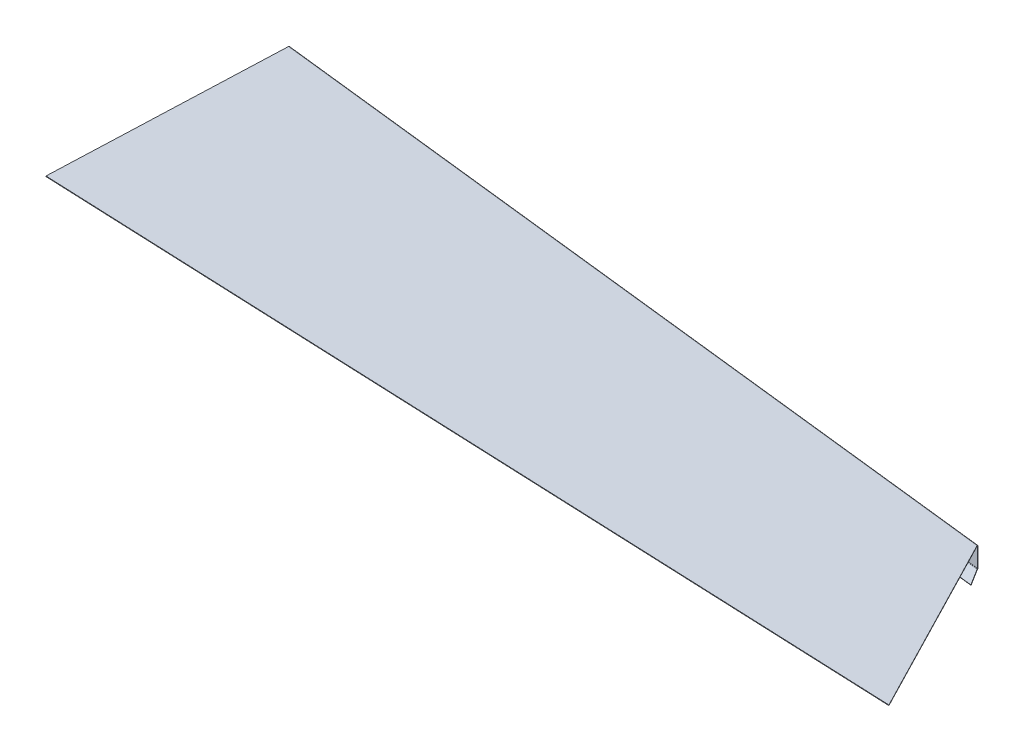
ISO-10303-21;
HEADER;
FILE_DESCRIPTION(('STEP AP214'),'2;1');
FILE_NAME('part.step','',(''),(''),'','','');
FILE_SCHEMA(('AUTOMOTIVE_DESIGN { 1 0 10303 214 1 1 1 1 }'));
ENDSEC;
DATA;
#1=APPLICATION_CONTEXT('core data for automotive mechanical design processes');
#2=APPLICATION_PROTOCOL_DEFINITION('international standard','automotive_design',2000,#1);
#3=PRODUCT_CONTEXT('',#1,'mechanical');
#4=PRODUCT('Part','Part','',(#3));
#5=PRODUCT_RELATED_PRODUCT_CATEGORY('part','',(#4));
#6=PRODUCT_DEFINITION_FORMATION('','',#4);
#7=PRODUCT_DEFINITION_CONTEXT('part definition',#1,'design');
#8=PRODUCT_DEFINITION('design','',#6,#7);
#9=PRODUCT_DEFINITION_SHAPE('','',#8);
#10=(LENGTH_UNIT() NAMED_UNIT(*) SI_UNIT(.MILLI.,.METRE.));
#11=(NAMED_UNIT(*) PLANE_ANGLE_UNIT() SI_UNIT($,.RADIAN.));
#12=(NAMED_UNIT(*) SI_UNIT($,.STERADIAN.) SOLID_ANGLE_UNIT());
#13=UNCERTAINTY_MEASURE_WITH_UNIT(LENGTH_MEASURE(1.E-05),#10,'distance_accuracy_value','');
#14=(GEOMETRIC_REPRESENTATION_CONTEXT(3) GLOBAL_UNCERTAINTY_ASSIGNED_CONTEXT((#13)) GLOBAL_UNIT_ASSIGNED_CONTEXT((#10,
#11,#12)) REPRESENTATION_CONTEXT('',''));
#15=CARTESIAN_POINT('',(0.,0.,0.));
#16=DIRECTION('',(0.,0.,1.));
#17=DIRECTION('',(1.,0.,0.));
#18=AXIS2_PLACEMENT_3D('',#15,#16,#17);
#19=CARTESIAN_POINT('',(2301.13573686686,1.05797401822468E-11,-908.760105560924));
#20=DIRECTION('',(0.993648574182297,0.,0.11252782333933));
#21=DIRECTION('',(0.,-1.,0.));
#22=AXIS2_PLACEMENT_3D('',#19,#20,#21);
#23=PLANE('',#22);
#24=DIRECTION('',(-0.11252782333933,0.,0.993648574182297));
#25=VECTOR('',#24,1.);
#26=CARTESIAN_POINT('',(2301.13573686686,-54.7487291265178,-908.760105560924));
#27=LINE('',#26,#25);
#28=CARTESIAN_POINT('',(2301.31866209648,-54.7487291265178,-910.375380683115));
#29=VERTEX_POINT('',#28);
#30=CARTESIAN_POINT('',(2301.13573686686,-54.7487291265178,-908.760105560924));
#31=VERTEX_POINT('',#30);
#32=EDGE_CURVE('E12',#29,#31,#27,.T.);
#33=ORIENTED_EDGE('',*,*,#32,.F.);
#34=DIRECTION('',(0.,1.,0.));
#35=VECTOR('',#34,1.);
#36=CARTESIAN_POINT('',(2301.31866209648,0.,-910.375380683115));
#37=LINE('',#36,#35);
#38=CARTESIAN_POINT('',(2301.31866209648,-1.62560000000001,-910.375380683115));
#39=VERTEX_POINT('',#38);
#40=EDGE_CURVE('E212',#39,#29,#37,.F.);
#41=ORIENTED_EDGE('',*,*,#40,.F.);
#42=DIRECTION('',(-0.112527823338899,0.,0.993648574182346));
#43=VECTOR('',#42,1.);
#44=CARTESIAN_POINT('',(2301.13573686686,-1.62560000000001,-908.760105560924));
#45=LINE('',#44,#43);
#46=CARTESIAN_POINT('',(2301.13573686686,-1.62560000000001,-908.760105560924));
#47=VERTEX_POINT('',#46);
#48=EDGE_CURVE('E160',#39,#47,#45,.T.);
#49=ORIENTED_EDGE('',*,*,#48,.T.);
#50=DIRECTION('',(0.,-1.,0.));
#51=VECTOR('',#50,1.);
#52=CARTESIAN_POINT('',(2301.13573686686,1.05797401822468E-11,-908.760105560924));
#53=LINE('',#52,#51);
#54=EDGE_CURVE('E215',#47,#31,#53,.T.);
#55=ORIENTED_EDGE('',*,*,#54,.T.);
#56=EDGE_LOOP('',(#33,#41,#49,#55));
#57=FACE_BOUND('',#56,.T.);
#58=ADVANCED_FACE('F147',(#57),#23,.T.);
#59=CARTESIAN_POINT('',(2302.74531050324,-1.62560000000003,-903.669853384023));
#60=CARTESIAN_POINT('',(2302.80628557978,-1.62560000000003,-904.208278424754));
#61=CARTESIAN_POINT('',(2302.86726065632,-1.62560000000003,-904.746703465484));
#62=CARTESIAN_POINT('',(2302.92823573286,-1.62560000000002,-905.285128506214));
#63=CARTESIAN_POINT('',(2302.74531050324,-8.12800000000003,-903.669853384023));
#64=CARTESIAN_POINT('',(2302.80628557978,-7.0442666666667,-904.208278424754));
#65=CARTESIAN_POINT('',(2302.86726065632,-5.96053333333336,-904.746703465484));
#66=CARTESIAN_POINT('',(2302.92823573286,-4.87680000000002,-905.285128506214));
#67=CARTESIAN_POINT('',(2301.31866209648,-8.12799999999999,-910.375380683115));
#68=CARTESIAN_POINT('',(2301.25768701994,-7.04426666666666,-909.836955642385));
#69=CARTESIAN_POINT('',(2301.1967119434,-5.96053333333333,-909.298530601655));
#70=CARTESIAN_POINT('',(2301.13573686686,-4.8768,-908.760105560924));
#71=CARTESIAN_POINT('',(2301.31866209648,-1.62559999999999,-910.375380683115));
#72=CARTESIAN_POINT('',(2301.25768701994,-1.62559999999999,-909.836955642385));
#73=CARTESIAN_POINT('',(2301.1967119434,-1.6256,-909.298530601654));
#74=CARTESIAN_POINT('',(2301.13573686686,-1.6256,-908.760105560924));
#75=CARTESIAN_POINT('',(2301.31866209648,4.87680000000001,-910.375380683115));
#76=CARTESIAN_POINT('',(2301.25768701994,3.79306666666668,-909.836955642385));
#77=CARTESIAN_POINT('',(2301.1967119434,2.70933333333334,-909.298530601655));
#78=CARTESIAN_POINT('',(2301.13573686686,1.6256,-908.760105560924));
#79=CARTESIAN_POINT('',(2302.74531050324,4.87679999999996,-903.669853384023));
#80=CARTESIAN_POINT('',(2302.80628557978,3.79306666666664,-904.208278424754));
#81=CARTESIAN_POINT('',(2302.86726065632,2.70933333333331,-904.746703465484));
#82=CARTESIAN_POINT('',(2302.92823573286,1.62559999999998,-905.285128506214));
#83=CARTESIAN_POINT('',(2302.74531050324,-1.62560000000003,-903.669853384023));
#84=CARTESIAN_POINT('',(2302.80628557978,-1.62560000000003,-904.208278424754));
#85=CARTESIAN_POINT('',(2302.86726065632,-1.62560000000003,-904.746703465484));
#86=CARTESIAN_POINT('',(2302.92823573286,-1.62560000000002,-905.285128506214));
#87=(BOUNDED_SURFACE() B_SPLINE_SURFACE(3,3,((#59,#60,#61,#62),(#63,#64,#65,#66),(#67,#68,#69,
#70),(#71,#72,#73,#74),(#75,#76,#77,#78),(#79,#80,#81,#82),(#83,#84,#85,#86)),.UNSPECIFIED.,.T.,
.F.,.F.) B_SPLINE_SURFACE_WITH_KNOTS((4,3,4),(4,4),(0.,0.5,1.),(0.,1.),
.UNSPECIFIED.) GEOMETRIC_REPRESENTATION_ITEM() RATIONAL_B_SPLINE_SURFACE(((1.,1.,1.,1.),
(0.333333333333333,0.333333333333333,0.333333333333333,0.333333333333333),(0.333333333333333,
0.333333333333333,0.333333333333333,0.333333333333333),(1.,1.,1.,1.),(0.333333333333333,
0.333333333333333,0.333333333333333,0.333333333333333),(0.333333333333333,0.333333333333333,
0.333333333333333,0.333333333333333),(1.,1.,1.,1.))) REPRESENTATION_ITEM('') SURFACE());
#88=CARTESIAN_POINT('',(2302.03198629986,-1.62560000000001,-907.022617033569));
#89=DIRECTION('',(-0.97810769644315,0.,0.208099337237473));
#90=DIRECTION('',(0.208099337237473,0.,0.97810769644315));
#91=AXIS2_PLACEMENT_3D('',#88,#89,#90);
#92=ELLIPSE('',#91,3.42780622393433,3.2512);
#93=CARTESIAN_POINT('',(2302.03198629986,1.62559999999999,-907.022617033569));
#94=VERTEX_POINT('',#93);
#95=EDGE_CURVE('E251',#39,#94,#92,.F.);
#96=DIRECTION('',(0.,-1.,0.));
#97=VECTOR('',#96,1.);
#98=CARTESIAN_POINT('',(2302.03198629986,0.,-907.022617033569));
#99=LINE('',#98,#97);
#100=CARTESIAN_POINT('',(2302.03198629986,0.,-907.022617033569));
#101=VERTEX_POINT('',#100);
#102=EDGE_CURVE('E290',#94,#101,#99,.T.);
#103=CARTESIAN_POINT('',(2302.03198629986,-1.62560000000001,-907.022617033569));
#104=DIRECTION('',(-0.888728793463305,0.,0.458433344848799));
#105=DIRECTION('',(0.458433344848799,0.,0.888728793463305));
#106=AXIS2_PLACEMENT_3D('',#103,#104,#105);
#107=ELLIPSE('',#106,1.95502670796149,1.6256);
#108=EDGE_CURVE('E310',#47,#101,#107,.F.);
#109=ORIENTED_EDGE('',*,*,#48,.F.);
#110=ORIENTED_EDGE('',*,*,#95,.T.);
#111=ORIENTED_EDGE('',*,*,#102,.T.);
#112=ORIENTED_EDGE('',*,*,#108,.F.);
#113=EDGE_LOOP('',(#109,#110,#111,#112));
#114=FACE_BOUND('',#113,.T.);
#115=ADVANCED_FACE('F311',(#114),#87,.T.);
#116=CARTESIAN_POINT('',(2187.77613611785,0.,-1128.52147836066));
#117=DIRECTION('',(0.888728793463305,0.,-0.458433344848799));
#118=DIRECTION('',(-0.458433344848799,0.,-0.888728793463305));
#119=AXIS2_PLACEMENT_3D('',#116,#117,#118);
#120=PLANE('',#119);
#121=ORIENTED_EDGE('',*,*,#102,.F.);
#122=DIRECTION('',(-0.458433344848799,0.,-0.888728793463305));
#123=VECTOR('',#122,1.);
#124=CARTESIAN_POINT('',(2187.77613611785,1.62559999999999,-1128.52147836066));
#125=LINE('',#124,#123);
#126=CARTESIAN_POINT('',(2566.10172430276,1.62559999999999,-395.091313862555));
#127=VERTEX_POINT('',#126);
#128=EDGE_CURVE('E359',#127,#94,#125,.T.);
#129=ORIENTED_EDGE('',*,*,#128,.F.);
#130=DIRECTION('',(0.,-1.,0.));
#131=VECTOR('',#130,1.);
#132=CARTESIAN_POINT('',(2566.10172430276,0.,-395.091313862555));
#133=LINE('',#132,#131);
#134=CARTESIAN_POINT('',(2566.10172430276,0.,-395.091313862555));
#135=VERTEX_POINT('',#134);
#136=EDGE_CURVE('E286',#127,#135,#133,.T.);
#137=ORIENTED_EDGE('',*,*,#136,.T.);
#138=DIRECTION('',(-0.458433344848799,0.,-0.888728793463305));
#139=VECTOR('',#138,1.);
#140=CARTESIAN_POINT('',(2187.77613611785,0.,-1128.52147836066));
#141=LINE('',#140,#139);
#142=EDGE_CURVE('E391',#135,#101,#141,.T.);
#143=ORIENTED_EDGE('',*,*,#142,.T.);
#144=EDGE_LOOP('',(#121,#129,#137,#143));
#145=FACE_BOUND('',#144,.T.);
#146=ADVANCED_FACE('F390',(#145),#120,.T.);
#147=CARTESIAN_POINT('',(2595.31009153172,0.,-393.873433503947));
#148=DIRECTION('',(-0.0416600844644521,0.,0.999131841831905));
#149=DIRECTION('',(0.999131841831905,0.,0.0416600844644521));
#150=AXIS2_PLACEMENT_3D('',#147,#148,#149);
#151=PLANE('',#150);
#152=ORIENTED_EDGE('',*,*,#136,.F.);
#153=DIRECTION('',(0.999131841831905,0.,0.0416600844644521));
#154=VECTOR('',#153,1.);
#155=CARTESIAN_POINT('',(2595.31009153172,1.62560000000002,-393.873433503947));
#156=LINE('',#155,#154);
#157=CARTESIAN_POINT('',(93.4092633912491,1.62559999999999,-498.193399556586));
#158=VERTEX_POINT('',#157);
#159=EDGE_CURVE('E365',#158,#127,#156,.T.);
#160=ORIENTED_EDGE('',*,*,#159,.F.);
#161=DIRECTION('',(0.,-1.,0.));
#162=VECTOR('',#161,1.);
#163=CARTESIAN_POINT('',(93.4092633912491,0.,-498.193399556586));
#164=LINE('',#163,#162);
#165=CARTESIAN_POINT('',(93.4092633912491,0.,-498.193399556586));
#166=VERTEX_POINT('',#165);
#167=EDGE_CURVE('E282',#158,#166,#164,.T.);
#168=ORIENTED_EDGE('',*,*,#167,.T.);
#169=DIRECTION('',(0.999131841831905,0.,0.0416600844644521));
#170=VECTOR('',#169,1.);
#171=CARTESIAN_POINT('',(2595.31009153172,0.,-393.873433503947));
#172=LINE('',#171,#170);
#173=EDGE_CURVE('E388',#166,#135,#172,.T.);
#174=ORIENTED_EDGE('',*,*,#173,.T.);
#175=EDGE_LOOP('',(#152,#160,#168,#174));
#176=FACE_BOUND('',#175,.T.);
#177=ADVANCED_FACE('F384',(#176),#151,.T.);
#178=CARTESIAN_POINT('',(73.7447952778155,0.,2.89401039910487));
#179=DIRECTION('',(0.999230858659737,0.,0.0392134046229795));
#180=DIRECTION('',(0.0392134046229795,0.,-0.999230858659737));
#181=AXIS2_PLACEMENT_3D('',#178,#179,#180);
#182=PLANE('',#181);
#183=ORIENTED_EDGE('',*,*,#167,.F.);
#184=DIRECTION('',(0.0392134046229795,0.,-0.999230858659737));
#185=VECTOR('',#184,1.);
#186=CARTESIAN_POINT('',(73.7447952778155,1.62559999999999,2.89401039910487));
#187=LINE('',#186,#185);
#188=CARTESIAN_POINT('',(119.154383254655,1.62559999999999,-1154.22718378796));
#189=VERTEX_POINT('',#188);
#190=EDGE_CURVE('E353',#158,#189,#187,.T.);
#191=ORIENTED_EDGE('',*,*,#190,.T.);
#192=DIRECTION('',(0.,-1.,0.));
#193=VECTOR('',#192,1.);
#194=CARTESIAN_POINT('',(119.154383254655,0.,-1154.22718378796));
#195=LINE('',#194,#193);
#196=CARTESIAN_POINT('',(119.154383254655,0.,-1154.22718378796));
#197=VERTEX_POINT('',#196);
#198=EDGE_CURVE('E168',#189,#197,#195,.T.);
#199=ORIENTED_EDGE('',*,*,#198,.T.);
#200=DIRECTION('',(0.0392134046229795,0.,-0.999230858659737));
#201=VECTOR('',#200,1.);
#202=CARTESIAN_POINT('',(73.7447952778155,0.,2.89401039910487));
#203=LINE('',#202,#201);
#204=EDGE_CURVE('E399',#166,#197,#203,.T.);
#205=ORIENTED_EDGE('',*,*,#204,.F.);
#206=EDGE_LOOP('',(#183,#191,#199,#205));
#207=FACE_BOUND('',#206,.T.);
#208=ADVANCED_FACE('F382',(#207),#182,.F.);
#209=CARTESIAN_POINT('',(118.90753993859,-1.62560000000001,-1150.98315632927));
#210=CARTESIAN_POINT('',(118.968515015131,-1.62560000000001,-1151.52158137));
#211=CARTESIAN_POINT('',(119.029490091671,-1.62560000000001,-1152.06000641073));
#212=CARTESIAN_POINT('',(119.090465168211,-1.62560000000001,-1152.59843145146));
#213=CARTESIAN_POINT('',(118.90753993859,4.87679999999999,-1150.98315632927));
#214=CARTESIAN_POINT('',(118.968515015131,3.79306666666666,-1151.52158137));
#215=CARTESIAN_POINT('',(119.029490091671,2.70933333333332,-1152.06000641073));
#216=CARTESIAN_POINT('',(119.090465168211,1.62559999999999,-1152.59843145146));
#217=CARTESIAN_POINT('',(119.40122657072,4.87679999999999,-1157.47121124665));
#218=CARTESIAN_POINT('',(119.34025149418,3.79306666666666,-1156.93278620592));
#219=CARTESIAN_POINT('',(119.27927641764,2.70933333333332,-1156.39436116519));
#220=CARTESIAN_POINT('',(119.2183013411,1.62559999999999,-1155.85593612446));
#221=CARTESIAN_POINT('',(119.40122657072,-1.62560000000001,-1157.47121124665));
#222=CARTESIAN_POINT('',(119.34025149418,-1.62560000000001,-1156.93278620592));
#223=CARTESIAN_POINT('',(119.27927641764,-1.62560000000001,-1156.39436116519));
#224=CARTESIAN_POINT('',(119.2183013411,-1.62560000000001,-1155.85593612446));
#225=CARTESIAN_POINT('',(119.40122657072,-8.12800000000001,-1157.47121124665));
#226=CARTESIAN_POINT('',(119.34025149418,-7.04426666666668,-1156.93278620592));
#227=CARTESIAN_POINT('',(119.27927641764,-5.96053333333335,-1156.39436116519));
#228=CARTESIAN_POINT('',(119.2183013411,-4.87680000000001,-1155.85593612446));
#229=CARTESIAN_POINT('',(118.90753993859,-8.12800000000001,-1150.98315632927));
#230=CARTESIAN_POINT('',(118.968515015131,-7.04426666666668,-1151.52158137));
#231=CARTESIAN_POINT('',(119.029490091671,-5.96053333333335,-1152.06000641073));
#232=CARTESIAN_POINT('',(119.090465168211,-4.87680000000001,-1152.59843145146));
#233=CARTESIAN_POINT('',(118.90753993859,-1.62560000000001,-1150.98315632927));
#234=CARTESIAN_POINT('',(118.968515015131,-1.62560000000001,-1151.52158137));
#235=CARTESIAN_POINT('',(119.029490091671,-1.62560000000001,-1152.06000641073));
#236=CARTESIAN_POINT('',(119.090465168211,-1.62560000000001,-1152.59843145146));
#237=(BOUNDED_SURFACE() B_SPLINE_SURFACE(3,3,((#209,#210,#211,#212),(#213,#214,#215,#216),(#217,
#218,#219,#220),(#221,#222,#223,#224),(#225,#226,#227,#228),(#229,#230,#231,#232),(#233,#234,
#235,#236)),.UNSPECIFIED.,.T.,.F.,.F.) B_SPLINE_SURFACE_WITH_KNOTS((4,3,4),(4,4),(0.,0.5,1.),
(0.,1.),.UNSPECIFIED.) GEOMETRIC_REPRESENTATION_ITEM() RATIONAL_B_SPLINE_SURFACE(((1.,1.,1.,1.),
(0.333333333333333,0.333333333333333,0.333333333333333,0.333333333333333),(0.333333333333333,
0.333333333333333,0.333333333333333,0.333333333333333),(1.,1.,1.,1.),(0.333333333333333,
0.333333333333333,0.333333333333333,0.333333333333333),(0.333333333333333,0.333333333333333,
0.333333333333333,0.333333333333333),(1.,1.,1.,1.))) REPRESENTATION_ITEM('') SURFACE());
#238=CARTESIAN_POINT('',(119.154383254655,-1.62560000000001,-1154.22718378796));
#239=DIRECTION('',(0.997117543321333,0.,0.0758722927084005));
#240=DIRECTION('',(-0.0758722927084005,0.,0.997117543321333));
#241=AXIS2_PLACEMENT_3D('',#238,#239,#240);
#242=ELLIPSE('',#241,3.25340525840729,3.2512);
#243=CARTESIAN_POINT('',(119.40122657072,-1.62560000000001,-1157.47121124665));
#244=VERTEX_POINT('',#243);
#245=EDGE_CURVE('E257',#189,#244,#242,.F.);
#246=DIRECTION('',(-0.11252782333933,0.,0.993648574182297));
#247=VECTOR('',#246,1.);
#248=CARTESIAN_POINT('',(119.2183013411,-1.62560000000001,-1155.85593612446));
#249=LINE('',#248,#247);
#250=CARTESIAN_POINT('',(119.2183013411,-1.62560000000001,-1155.85593612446));
#251=VERTEX_POINT('',#250);
#252=EDGE_CURVE('E276',#244,#251,#249,.T.);
#253=CARTESIAN_POINT('',(119.154383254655,-1.62560000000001,-1154.22718378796));
#254=DIRECTION('',(0.999230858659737,0.,0.0392134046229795));
#255=DIRECTION('',(-0.0392134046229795,0.,0.999230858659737));
#256=AXIS2_PLACEMENT_3D('',#253,#254,#255);
#257=ELLIPSE('',#256,1.6300060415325,1.6256);
#258=EDGE_CURVE('E317',#197,#251,#257,.F.);
#259=ORIENTED_EDGE('',*,*,#198,.F.);
#260=ORIENTED_EDGE('',*,*,#245,.T.);
#261=ORIENTED_EDGE('',*,*,#252,.T.);
#262=ORIENTED_EDGE('',*,*,#258,.F.);
#263=EDGE_LOOP('',(#259,#260,#261,#262));
#264=FACE_BOUND('',#263,.T.);
#265=ADVANCED_FACE('F455',(#264),#237,.T.);
#266=CARTESIAN_POINT('',(119.2183013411,0.,-1155.85593612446));
#267=DIRECTION('',(0.993648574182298,0.,0.11252782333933));
#268=DIRECTION('',(0.,-1.,0.));
#269=AXIS2_PLACEMENT_3D('',#266,#267,#268);
#270=PLANE('',#269);
#271=ORIENTED_EDGE('',*,*,#252,.F.);
#272=DIRECTION('',(0.,1.,0.));
#273=VECTOR('',#272,1.);
#274=CARTESIAN_POINT('',(119.40122657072,0.,-1157.47121124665));
#275=LINE('',#274,#273);
#276=CARTESIAN_POINT('',(119.40122657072,-54.7487291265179,-1157.47121124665));
#277=VERTEX_POINT('',#276);
#278=EDGE_CURVE('E245',#244,#277,#275,.F.);
#279=ORIENTED_EDGE('',*,*,#278,.T.);
#280=DIRECTION('',(-0.112527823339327,0.,0.993648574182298));
#281=VECTOR('',#280,1.);
#282=CARTESIAN_POINT('',(119.2183013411,-54.7487291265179,-1155.85593612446));
#283=LINE('',#282,#281);
#284=CARTESIAN_POINT('',(119.2183013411,-54.7487291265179,-1155.85593612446));
#285=VERTEX_POINT('',#284);
#286=EDGE_CURVE('E272',#277,#285,#283,.T.);
#287=ORIENTED_EDGE('',*,*,#286,.T.);
#288=DIRECTION('',(0.,-1.,0.));
#289=VECTOR('',#288,1.);
#290=CARTESIAN_POINT('',(119.2183013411,0.,-1155.85593612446));
#291=LINE('',#290,#289);
#292=EDGE_CURVE('E306',#251,#285,#291,.T.);
#293=ORIENTED_EDGE('',*,*,#292,.F.);
#294=EDGE_LOOP('',(#271,#279,#287,#293));
#295=FACE_BOUND('',#294,.T.);
#296=ADVANCED_FACE('F457',(#295),#270,.F.);
#297=CARTESIAN_POINT('',(119.090465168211,-54.7487291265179,-1152.59843145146));
#298=CARTESIAN_POINT('',(119.029490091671,-54.7487291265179,-1152.06000641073));
#299=CARTESIAN_POINT('',(118.968515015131,-54.7487291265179,-1151.52158137));
#300=CARTESIAN_POINT('',(118.90753993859,-54.7487291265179,-1150.98315632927));
#301=CARTESIAN_POINT('',(119.090465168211,-51.4975291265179,-1152.59843145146));
#302=CARTESIAN_POINT('',(119.029490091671,-50.4137957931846,-1152.06000641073));
#303=CARTESIAN_POINT('',(118.968515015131,-49.3300624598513,-1151.52158137));
#304=CARTESIAN_POINT('',(118.90753993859,-48.2463291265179,-1150.98315632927));
#305=CARTESIAN_POINT('',(119.2183013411,-51.4975291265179,-1155.85593612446));
#306=CARTESIAN_POINT('',(119.27927641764,-50.4137957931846,-1156.39436116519));
#307=CARTESIAN_POINT('',(119.34025149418,-49.3300624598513,-1156.93278620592));
#308=CARTESIAN_POINT('',(119.40122657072,-48.2463291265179,-1157.47121124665));
#309=CARTESIAN_POINT('',(119.2183013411,-54.7487291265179,-1155.85593612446));
#310=CARTESIAN_POINT('',(119.27927641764,-54.7487291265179,-1156.39436116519));
#311=CARTESIAN_POINT('',(119.34025149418,-54.7487291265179,-1156.93278620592));
#312=CARTESIAN_POINT('',(119.40122657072,-54.7487291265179,-1157.47121124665));
#313=CARTESIAN_POINT('',(119.2183013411,-57.9999291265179,-1155.85593612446));
#314=CARTESIAN_POINT('',(119.27927641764,-59.0836624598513,-1156.39436116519));
#315=CARTESIAN_POINT('',(119.34025149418,-60.1673957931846,-1156.93278620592));
#316=CARTESIAN_POINT('',(119.40122657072,-61.2511291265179,-1157.47121124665));
#317=CARTESIAN_POINT('',(119.090465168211,-57.9999291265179,-1152.59843145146));
#318=CARTESIAN_POINT('',(119.029490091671,-59.0836624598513,-1152.06000641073));
#319=CARTESIAN_POINT('',(118.968515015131,-60.1673957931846,-1151.52158137));
#320=CARTESIAN_POINT('',(118.90753993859,-61.2511291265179,-1150.98315632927));
#321=CARTESIAN_POINT('',(119.090465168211,-54.7487291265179,-1152.59843145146));
#322=CARTESIAN_POINT('',(119.029490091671,-54.7487291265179,-1152.06000641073));
#323=CARTESIAN_POINT('',(118.968515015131,-54.7487291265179,-1151.52158137));
#324=CARTESIAN_POINT('',(118.90753993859,-54.7487291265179,-1150.98315632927));
#325=(BOUNDED_SURFACE() B_SPLINE_SURFACE(3,3,((#297,#298,#299,#300),(#301,#302,#303,#304),(#305,
#306,#307,#308),(#309,#310,#311,#312),(#313,#314,#315,#316),(#317,#318,#319,#320),(#321,#322,
#323,#324)),.UNSPECIFIED.,.T.,.F.,.F.) B_SPLINE_SURFACE_WITH_KNOTS((4,3,4),(4,4),(0.,0.5,1.),
(0.,1.),.UNSPECIFIED.) GEOMETRIC_REPRESENTATION_ITEM() RATIONAL_B_SPLINE_SURFACE(((1.,1.,1.,1.),
(0.333333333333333,0.333333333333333,0.333333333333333,0.333333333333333),(0.333333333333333,
0.333333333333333,0.333333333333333,0.333333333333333),(1.,1.,1.,1.),(0.333333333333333,
0.333333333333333,0.333333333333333,0.333333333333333),(0.333333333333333,0.333333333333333,
0.333333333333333,0.333333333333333),(1.,1.,1.,1.))) REPRESENTATION_ITEM('') SURFACE());
#326=CARTESIAN_POINT('',(119.154383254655,-54.7487291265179,-1154.22718378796));
#327=DIRECTION('',(-0.997117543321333,0.,-0.0758722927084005));
#328=DIRECTION('',(-0.0758722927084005,0.,0.997117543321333));
#329=AXIS2_PLACEMENT_3D('',#326,#327,#328);
#330=ELLIPSE('',#329,3.25340525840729,3.2512);
#331=CARTESIAN_POINT('',(119.226974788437,-57.8561642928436,-1155.18118543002));
#332=VERTEX_POINT('',#331);
#333=EDGE_CURVE('E231',#277,#332,#330,.T.);
#334=DIRECTION('',(-0.0330921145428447,0.955780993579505,0.292211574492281));
#335=VECTOR('',#334,1.);
#336=CARTESIAN_POINT('',(119.173180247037,-56.3024467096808,-1154.70616629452));
#337=LINE('',#336,#335);
#338=CARTESIAN_POINT('',(119.173180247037,-56.3024467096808,-1154.70616629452));
#339=VERTEX_POINT('',#338);
#340=EDGE_CURVE('E268',#332,#339,#337,.T.);
#341=CARTESIAN_POINT('',(119.154383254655,-54.7487291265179,-1154.22718378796));
#342=DIRECTION('',(-0.999230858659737,0.,-0.0392134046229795));
#343=DIRECTION('',(-0.0392134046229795,0.,0.999230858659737));
#344=AXIS2_PLACEMENT_3D('',#341,#342,#343);
#345=ELLIPSE('',#344,1.6300060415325,1.6256);
#346=EDGE_CURVE('E307',#285,#339,#345,.T.);
#347=ORIENTED_EDGE('',*,*,#286,.F.);
#348=ORIENTED_EDGE('',*,*,#333,.T.);
#349=ORIENTED_EDGE('',*,*,#340,.T.);
#350=ORIENTED_EDGE('',*,*,#346,.F.);
#351=EDGE_LOOP('',(#347,#348,#349,#350));
#352=FACE_BOUND('',#351,.T.);
#353=ADVANCED_FACE('F458',(#352),#325,.F.);
#354=CARTESIAN_POINT('',(78.2733519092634,-376.35229207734,-112.502078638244));
#355=DIRECTION('',(0.998748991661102,0.0206573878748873,0.0455381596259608));
#356=DIRECTION('',(0.0374881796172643,0.293352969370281,-0.955268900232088));
#357=AXIS2_PLACEMENT_3D('',#354,#355,#356);
#358=PLANE('',#357);
#359=ORIENTED_EDGE('',*,*,#340,.F.);
#360=DIRECTION('',(0.0374881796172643,0.293352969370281,-0.955268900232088));
#361=VECTOR('',#360,1.);
#362=CARTESIAN_POINT('',(78.3271464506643,-377.906009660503,-112.977097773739));
#363=LINE('',#362,#361);
#364=CARTESIAN_POINT('',(117.888917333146,-68.326748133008,-1121.08497999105));
#365=VERTEX_POINT('',#364);
#366=EDGE_CURVE('E237',#365,#332,#363,.T.);
#367=ORIENTED_EDGE('',*,*,#366,.F.);
#368=DIRECTION('',(-0.0330921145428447,0.955780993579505,0.292211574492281));
#369=VECTOR('',#368,1.);
#370=CARTESIAN_POINT('',(117.835122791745,-66.7730305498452,-1120.60996085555));
#371=LINE('',#370,#369);
#372=CARTESIAN_POINT('',(117.835122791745,-66.7730305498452,-1120.60996085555));
#373=VERTEX_POINT('',#372);
#374=EDGE_CURVE('E264',#365,#373,#371,.T.);
#375=ORIENTED_EDGE('',*,*,#374,.T.);
#376=DIRECTION('',(0.0374881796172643,0.293352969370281,-0.955268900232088));
#377=VECTOR('',#376,1.);
#378=CARTESIAN_POINT('',(78.2733519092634,-376.35229207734,-112.502078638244));
#379=LINE('',#378,#377);
#380=EDGE_CURVE('E417',#373,#339,#379,.T.);
#381=ORIENTED_EDGE('',*,*,#380,.T.);
#382=EDGE_LOOP('',(#359,#367,#375,#381));
#383=FACE_BOUND('',#382,.T.);
#384=ADVANCED_FACE('F436',(#383),#358,.F.);
#385=CARTESIAN_POINT('',(92.493044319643,-66.7730305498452,-1123.4798778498));
#386=DIRECTION('',(-0.107551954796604,-0.294079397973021,0.949710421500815));
#387=DIRECTION('',(0.993648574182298,0.,0.11252782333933));
#388=AXIS2_PLACEMENT_3D('',#385,#386,#387);
#389=PLANE('',#388);
#390=ORIENTED_EDGE('',*,*,#374,.F.);
#391=DIRECTION('',(0.993648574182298,0.,0.11252782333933));
#392=VECTOR('',#391,1.);
#393=CARTESIAN_POINT('',(92.5468388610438,-68.3267481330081,-1123.9548969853));
#394=LINE('',#393,#392);
#395=CARTESIAN_POINT('',(2320.58424516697,-68.3267481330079,-871.636113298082));
#396=VERTEX_POINT('',#395);
#397=EDGE_CURVE('E349',#365,#396,#394,.T.);
#398=ORIENTED_EDGE('',*,*,#397,.T.);
#399=DIRECTION('',(-0.0330921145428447,0.955780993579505,0.292211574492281));
#400=VECTOR('',#399,1.);
#401=CARTESIAN_POINT('',(2320.53045062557,-66.7730305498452,-871.161094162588));
#402=LINE('',#401,#400);
#403=CARTESIAN_POINT('',(2320.53045062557,-66.7730305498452,-871.161094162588));
#404=VERTEX_POINT('',#403);
#405=EDGE_CURVE('E260',#396,#404,#402,.T.);
#406=ORIENTED_EDGE('',*,*,#405,.T.);
#407=DIRECTION('',(0.993648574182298,0.,0.11252782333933));
#408=VECTOR('',#407,1.);
#409=CARTESIAN_POINT('',(92.493044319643,-66.7730305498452,-1123.4798778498));
#410=LINE('',#409,#408);
#411=EDGE_CURVE('E407',#373,#404,#410,.T.);
#412=ORIENTED_EDGE('',*,*,#411,.F.);
#413=EDGE_LOOP('',(#390,#398,#406,#412));
#414=FACE_BOUND('',#413,.T.);
#415=ADVANCED_FACE('F462',(#414),#389,.T.);
#416=CARTESIAN_POINT('',(2188.58121432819,6.86427488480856,-1126.96073633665));
#417=DIRECTION('',(0.895351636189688,0.158271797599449,-0.416287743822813));
#418=DIRECTION('',(-0.444128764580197,0.247856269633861,-0.860997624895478));
#419=AXIS2_PLACEMENT_3D('',#416,#417,#418);
#420=PLANE('',#419);
#421=ORIENTED_EDGE('',*,*,#405,.F.);
#422=DIRECTION('',(-0.444128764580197,0.247856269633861,-0.860997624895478));
#423=VECTOR('',#422,1.);
#424=CARTESIAN_POINT('',(2188.63500886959,5.3105573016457,-1127.43575547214));
#425=LINE('',#424,#423);
#426=CARTESIAN_POINT('',(2301.82221234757,-57.8561642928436,-908.008595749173));
#427=VERTEX_POINT('',#426);
#428=EDGE_CURVE('E346',#396,#427,#425,.T.);
#429=ORIENTED_EDGE('',*,*,#428,.T.);
#430=DIRECTION('',(-0.0330921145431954,0.955780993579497,0.292211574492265));
#431=VECTOR('',#430,1.);
#432=CARTESIAN_POINT('',(2301.76841780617,-56.3024467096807,-907.533576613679));
#433=LINE('',#432,#431);
#434=CARTESIAN_POINT('',(2301.76841780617,-56.3024467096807,-907.533576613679));
#435=VERTEX_POINT('',#434);
#436=EDGE_CURVE('E153',#427,#435,#433,.T.);
#437=ORIENTED_EDGE('',*,*,#436,.T.);
#438=DIRECTION('',(-0.444128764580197,0.247856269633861,-0.860997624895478));
#439=VECTOR('',#438,1.);
#440=CARTESIAN_POINT('',(2188.58121432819,6.86427488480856,-1126.96073633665));
#441=LINE('',#440,#439);
#442=EDGE_CURVE('E411',#404,#435,#441,.T.);
#443=ORIENTED_EDGE('',*,*,#442,.F.);
#444=EDGE_LOOP('',(#421,#429,#437,#443));
#445=FACE_BOUND('',#444,.T.);
#446=ADVANCED_FACE('F446',(#445),#420,.T.);
#447=CARTESIAN_POINT('',(2302.92823573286,-54.7487291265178,-905.285128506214));
#448=CARTESIAN_POINT('',(2302.86726065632,-54.7487291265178,-904.746703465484));
#449=CARTESIAN_POINT('',(2302.80628557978,-54.7487291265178,-904.208278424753));
#450=CARTESIAN_POINT('',(2302.74531050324,-54.7487291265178,-903.669853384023));
#451=CARTESIAN_POINT('',(2302.92823573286,-57.9999291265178,-905.285128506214));
#452=CARTESIAN_POINT('',(2302.86726065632,-59.0836624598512,-904.746703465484));
#453=CARTESIAN_POINT('',(2302.80628557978,-60.1673957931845,-904.208278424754));
#454=CARTESIAN_POINT('',(2302.74531050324,-61.2511291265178,-903.669853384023));
#455=CARTESIAN_POINT('',(2301.13573686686,-57.9999291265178,-908.760105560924));
#456=CARTESIAN_POINT('',(2301.1967119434,-59.0836624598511,-909.298530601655));
#457=CARTESIAN_POINT('',(2301.25768701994,-60.1673957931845,-909.836955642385));
#458=CARTESIAN_POINT('',(2301.31866209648,-61.2511291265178,-910.375380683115));
#459=CARTESIAN_POINT('',(2301.13573686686,-54.7487291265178,-908.760105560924));
#460=CARTESIAN_POINT('',(2301.1967119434,-54.7487291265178,-909.298530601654));
#461=CARTESIAN_POINT('',(2301.25768701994,-54.7487291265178,-909.836955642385));
#462=CARTESIAN_POINT('',(2301.31866209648,-54.7487291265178,-910.375380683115));
#463=CARTESIAN_POINT('',(2301.13573686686,-51.4975291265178,-908.760105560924));
#464=CARTESIAN_POINT('',(2301.1967119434,-50.4137957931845,-909.298530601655));
#465=CARTESIAN_POINT('',(2301.25768701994,-49.3300624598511,-909.836955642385));
#466=CARTESIAN_POINT('',(2301.31866209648,-48.2463291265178,-910.375380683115));
#467=CARTESIAN_POINT('',(2302.92823573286,-51.4975291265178,-905.285128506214));
#468=CARTESIAN_POINT('',(2302.86726065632,-50.4137957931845,-904.746703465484));
#469=CARTESIAN_POINT('',(2302.80628557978,-49.3300624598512,-904.208278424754));
#470=CARTESIAN_POINT('',(2302.74531050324,-48.2463291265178,-903.669853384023));
#471=CARTESIAN_POINT('',(2302.92823573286,-54.7487291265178,-905.285128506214));
#472=CARTESIAN_POINT('',(2302.86726065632,-54.7487291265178,-904.746703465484));
#473=CARTESIAN_POINT('',(2302.80628557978,-54.7487291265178,-904.208278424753));
#474=CARTESIAN_POINT('',(2302.74531050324,-54.7487291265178,-903.669853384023));
#475=(BOUNDED_SURFACE() B_SPLINE_SURFACE(3,3,((#447,#448,#449,#450),(#451,#452,#453,#454),(#455,
#456,#457,#458),(#459,#460,#461,#462),(#463,#464,#465,#466),(#467,#468,#469,#470),(#471,#472,
#473,#474)),.UNSPECIFIED.,.T.,.F.,.F.) B_SPLINE_SURFACE_WITH_KNOTS((4,3,4),(4,4),(0.,0.5,1.),
(0.,1.),.UNSPECIFIED.) GEOMETRIC_REPRESENTATION_ITEM() RATIONAL_B_SPLINE_SURFACE(((1.,1.,1.,1.),
(0.333333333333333,0.333333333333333,0.333333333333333,0.333333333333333),(0.333333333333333,
0.333333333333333,0.333333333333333,0.333333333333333),(1.,1.,1.,1.),(0.333333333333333,
0.333333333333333,0.333333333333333,0.333333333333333),(0.333333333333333,0.333333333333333,
0.333333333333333,0.333333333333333),(1.,1.,1.,1.))) REPRESENTATION_ITEM('') SURFACE());
#476=CARTESIAN_POINT('',(2302.03198629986,-54.7487291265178,-907.022617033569));
#477=DIRECTION('',(0.97810769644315,0.,-0.208099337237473));
#478=DIRECTION('',(0.208099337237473,0.,0.97810769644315));
#479=AXIS2_PLACEMENT_3D('',#476,#477,#478);
#480=ELLIPSE('',#479,3.42780622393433,3.2512);
#481=EDGE_CURVE('E228',#427,#29,#480,.T.);
#482=CARTESIAN_POINT('',(2302.03198629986,-54.7487291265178,-907.022617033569));
#483=DIRECTION('',(0.888728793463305,0.,-0.458433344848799));
#484=DIRECTION('',(0.458433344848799,0.,0.888728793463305));
#485=AXIS2_PLACEMENT_3D('',#482,#483,#484);
#486=ELLIPSE('',#485,1.95502670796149,1.6256);
#487=EDGE_CURVE('E316',#435,#31,#486,.T.);
#488=ORIENTED_EDGE('',*,*,#481,.T.);
#489=ORIENTED_EDGE('',*,*,#32,.T.);
#490=ORIENTED_EDGE('',*,*,#487,.F.);
#491=ORIENTED_EDGE('',*,*,#436,.F.);
#492=EDGE_LOOP('',(#488,#489,#490,#491));
#493=FACE_BOUND('',#492,.T.);
#494=ADVANCED_FACE('F149',(#493),#475,.F.);
#495=CARTESIAN_POINT('',(13.0771766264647,-377.700761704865,-115.474711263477));
#496=DIRECTION('',(-0.0330921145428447,0.955780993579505,0.292211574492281));
#497=DIRECTION('',(0.,-0.292371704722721,0.95630475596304));
#498=AXIS2_PLACEMENT_3D('',#495,#496,#497);
#499=PLANE('',#498);
#500=ORIENTED_EDGE('',*,*,#442,.T.);
#501=DIRECTION('',(0.993648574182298,0.,0.11252782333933));
#502=VECTOR('',#501,1.);
#503=CARTESIAN_POINT('',(130.620320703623,-56.3024467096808,-1153.40981078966));
#504=LINE('',#503,#502);
#505=EDGE_CURVE('E325',#435,#339,#504,.F.);
#506=ORIENTED_EDGE('',*,*,#505,.T.);
#507=ORIENTED_EDGE('',*,*,#380,.F.);
#508=ORIENTED_EDGE('',*,*,#411,.T.);
#509=EDGE_LOOP('',(#500,#506,#507,#508));
#510=FACE_BOUND('',#509,.T.);
#511=ADVANCED_FACE('F441',(#510),#499,.T.);
#512=CARTESIAN_POINT('',(0.,0.,0.));
#513=DIRECTION('',(0.,1.,0.));
#514=DIRECTION('',(0.,0.,1.));
#515=AXIS2_PLACEMENT_3D('',#512,#513,#514);
#516=PLANE('',#515);
#517=ORIENTED_EDGE('',*,*,#204,.T.);
#518=DIRECTION('',(-0.993648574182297,0.,-0.11252782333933));
#519=VECTOR('',#518,1.);
#520=CARTESIAN_POINT('',(2300.95281163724,0.,-907.144830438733));
#521=LINE('',#520,#519);
#522=EDGE_CURVE('E324',#197,#101,#521,.F.);
#523=ORIENTED_EDGE('',*,*,#522,.T.);
#524=ORIENTED_EDGE('',*,*,#142,.F.);
#525=ORIENTED_EDGE('',*,*,#173,.F.);
#526=EDGE_LOOP('',(#517,#523,#524,#525));
#527=FACE_BOUND('',#526,.T.);
#528=ADVANCED_FACE('F394',(#527),#516,.F.);
#529=CARTESIAN_POINT('',(130.749451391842,0.,-1154.55006677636));
#530=DIRECTION('',(0.11252782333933,0.,-0.993648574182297));
#531=DIRECTION('',(-0.993648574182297,0.,-0.11252782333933));
#532=AXIS2_PLACEMENT_3D('',#529,#530,#531);
#533=PLANE('',#532);
#534=ORIENTED_EDGE('',*,*,#54,.F.);
#535=DIRECTION('',(-0.993648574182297,0.,-0.11252782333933));
#536=VECTOR('',#535,1.);
#537=CARTESIAN_POINT('',(119.2183013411,-1.62560000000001,-1155.85593612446));
#538=LINE('',#537,#536);
#539=EDGE_CURVE('E302',#47,#251,#538,.T.);
#540=ORIENTED_EDGE('',*,*,#539,.T.);
#541=ORIENTED_EDGE('',*,*,#292,.T.);
#542=DIRECTION('',(0.993648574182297,0.,0.11252782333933));
#543=VECTOR('',#542,1.);
#544=CARTESIAN_POINT('',(130.749451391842,-54.7487291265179,-1154.55006677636));
#545=LINE('',#544,#543);
#546=EDGE_CURVE('E304',#285,#31,#545,.T.);
#547=ORIENTED_EDGE('',*,*,#546,.T.);
#548=EDGE_LOOP('',(#534,#540,#541,#547));
#549=FACE_BOUND('',#548,.T.);
#550=ADVANCED_FACE('F299',(#549),#533,.F.);
#551=CARTESIAN_POINT('',(130.566526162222,-54.7487291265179,-1152.93479165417));
#552=DIRECTION('',(0.993648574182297,0.,0.11252782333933));
#553=DIRECTION('',(0.11252782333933,0.,-0.993648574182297));
#554=AXIS2_PLACEMENT_3D('',#551,#552,#553);
#555=CYLINDRICAL_SURFACE('',#554,1.6256);
#556=ORIENTED_EDGE('',*,*,#346,.T.);
#557=ORIENTED_EDGE('',*,*,#505,.F.);
#558=ORIENTED_EDGE('',*,*,#487,.T.);
#559=ORIENTED_EDGE('',*,*,#546,.F.);
#560=EDGE_LOOP('',(#556,#557,#558,#559));
#561=FACE_BOUND('',#560,.T.);
#562=ADVANCED_FACE('F429',(#561),#555,.F.);
#563=CARTESIAN_POINT('',(130.566526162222,-1.62560000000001,-1152.93479165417));
#564=DIRECTION('',(0.993648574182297,0.,0.11252782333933));
#565=DIRECTION('',(0.11252782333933,0.,-0.993648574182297));
#566=AXIS2_PLACEMENT_3D('',#563,#564,#565);
#567=CYLINDRICAL_SURFACE('',#566,1.6256);
#568=ORIENTED_EDGE('',*,*,#108,.T.);
#569=ORIENTED_EDGE('',*,*,#522,.F.);
#570=ORIENTED_EDGE('',*,*,#258,.T.);
#571=ORIENTED_EDGE('',*,*,#539,.F.);
#572=EDGE_LOOP('',(#568,#569,#570,#571));
#573=FACE_BOUND('',#572,.T.);
#574=ADVANCED_FACE('F320',(#573),#567,.F.);
#575=CARTESIAN_POINT('',(13.1309711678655,-379.254479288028,-115.949730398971));
#576=DIRECTION('',(-0.0330921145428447,0.955780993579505,0.292211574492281));
#577=DIRECTION('',(0.,-0.292371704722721,0.95630475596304));
#578=AXIS2_PLACEMENT_3D('',#575,#576,#577);
#579=PLANE('',#578);
#580=ORIENTED_EDGE('',*,*,#428,.F.);
#581=ORIENTED_EDGE('',*,*,#397,.F.);
#582=ORIENTED_EDGE('',*,*,#366,.T.);
#583=DIRECTION('',(0.993648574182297,0.,0.11252782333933));
#584=VECTOR('',#583,1.);
#585=CARTESIAN_POINT('',(130.674115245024,-57.8561642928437,-1153.88482992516));
#586=LINE('',#585,#584);
#587=EDGE_CURVE('E236',#427,#332,#586,.F.);
#588=ORIENTED_EDGE('',*,*,#587,.F.);
#589=EDGE_LOOP('',(#580,#581,#582,#588));
#590=FACE_BOUND('',#589,.T.);
#591=ADVANCED_FACE('F461',(#590),#579,.F.);
#592=CARTESIAN_POINT('',(0.,1.62559999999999,0.));
#593=DIRECTION('',(0.,1.,0.));
#594=DIRECTION('',(0.,0.,1.));
#595=AXIS2_PLACEMENT_3D('',#592,#593,#594);
#596=PLANE('',#595);
#597=ORIENTED_EDGE('',*,*,#190,.F.);
#598=ORIENTED_EDGE('',*,*,#159,.T.);
#599=ORIENTED_EDGE('',*,*,#128,.T.);
#600=DIRECTION('',(0.993648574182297,0.,0.11252782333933));
#601=VECTOR('',#600,1.);
#602=CARTESIAN_POINT('',(130.566526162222,1.62559999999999,-1152.93479165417));
#603=LINE('',#602,#601);
#604=EDGE_CURVE('E337',#189,#94,#603,.T.);
#605=ORIENTED_EDGE('',*,*,#604,.F.);
#606=EDGE_LOOP('',(#597,#598,#599,#605));
#607=FACE_BOUND('',#606,.T.);
#608=ADVANCED_FACE('F375',(#607),#596,.T.);
#609=CARTESIAN_POINT('',(130.932376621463,0.,-1156.16534189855));
#610=DIRECTION('',(0.11252782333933,0.,-0.993648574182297));
#611=DIRECTION('',(-0.993648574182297,0.,-0.11252782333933));
#612=AXIS2_PLACEMENT_3D('',#609,#610,#611);
#613=PLANE('',#612);
#614=ORIENTED_EDGE('',*,*,#40,.T.);
#615=DIRECTION('',(-0.993648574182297,0.,-0.11252782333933));
#616=VECTOR('',#615,1.);
#617=CARTESIAN_POINT('',(130.932376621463,-54.7487291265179,-1156.16534189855));
#618=LINE('',#617,#616);
#619=EDGE_CURVE('E225',#277,#29,#618,.F.);
#620=ORIENTED_EDGE('',*,*,#619,.F.);
#621=ORIENTED_EDGE('',*,*,#278,.F.);
#622=DIRECTION('',(-0.993648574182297,0.,-0.11252782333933));
#623=VECTOR('',#622,1.);
#624=CARTESIAN_POINT('',(130.932376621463,-1.62560000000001,-1156.16534189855));
#625=LINE('',#624,#623);
#626=EDGE_CURVE('E242',#39,#244,#625,.T.);
#627=ORIENTED_EDGE('',*,*,#626,.F.);
#628=EDGE_LOOP('',(#614,#620,#621,#627));
#629=FACE_BOUND('',#628,.T.);
#630=ADVANCED_FACE('F240',(#629),#613,.T.);
#631=CARTESIAN_POINT('',(130.566526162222,-54.7487291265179,-1152.93479165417));
#632=DIRECTION('',(0.993648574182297,0.,0.11252782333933));
#633=DIRECTION('',(0.11252782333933,0.,-0.993648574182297));
#634=AXIS2_PLACEMENT_3D('',#631,#632,#633);
#635=CYLINDRICAL_SURFACE('',#634,3.2512);
#636=ORIENTED_EDGE('',*,*,#333,.F.);
#637=ORIENTED_EDGE('',*,*,#619,.T.);
#638=ORIENTED_EDGE('',*,*,#481,.F.);
#639=ORIENTED_EDGE('',*,*,#587,.T.);
#640=EDGE_LOOP('',(#636,#637,#638,#639));
#641=FACE_BOUND('',#640,.T.);
#642=ADVANCED_FACE('F226',(#641),#635,.T.);
#643=CARTESIAN_POINT('',(130.566526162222,-1.62560000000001,-1152.93479165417));
#644=DIRECTION('',(0.993648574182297,0.,0.11252782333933));
#645=DIRECTION('',(0.11252782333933,0.,-0.993648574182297));
#646=AXIS2_PLACEMENT_3D('',#643,#644,#645);
#647=CYLINDRICAL_SURFACE('',#646,3.2512);
#648=ORIENTED_EDGE('',*,*,#95,.F.);
#649=ORIENTED_EDGE('',*,*,#626,.T.);
#650=ORIENTED_EDGE('',*,*,#245,.F.);
#651=ORIENTED_EDGE('',*,*,#604,.T.);
#652=EDGE_LOOP('',(#648,#649,#650,#651));
#653=FACE_BOUND('',#652,.T.);
#654=ADVANCED_FACE('F380',(#653),#647,.T.);
#655=CLOSED_SHELL('',(#58,#115,#146,#177,#208,#265,#296,#353,#384,#415,#446,#494,#511,#528,#550,
#562,#574,#591,#608,#630,#642,#654));
#656=MANIFOLD_SOLID_BREP('B2',#655);
#657=ADVANCED_BREP_SHAPE_REPRESENTATION('',(#18,#656),#14);
#658=SHAPE_DEFINITION_REPRESENTATION(#9,#657);
ENDSEC;
END-ISO-10303-21;
